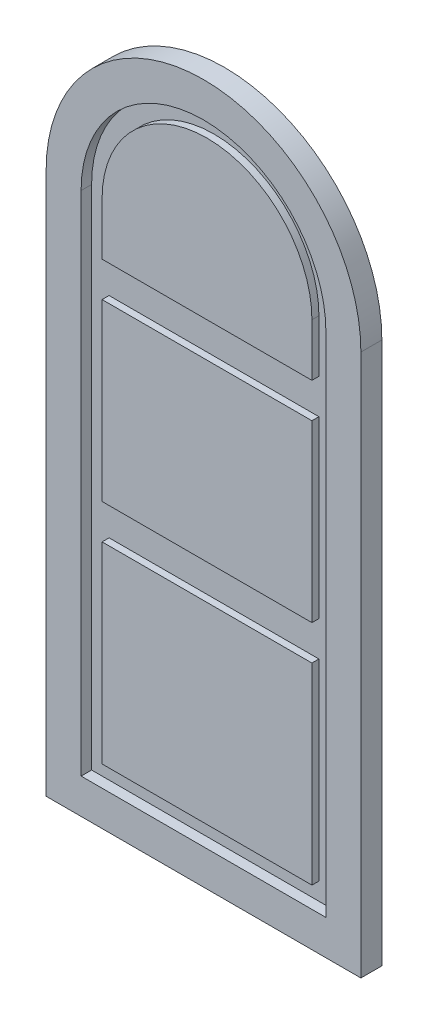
from build123d import *

# Parameters (mm, degrees)
SALIENTE_EXTRUIR1_DEPTH   = 60
SALIENTE_EXTRUIR2_DEPTH   = 50
CROQUIS1_3_W              = 600
CROQUIS1_3_H              = 500
SALIENTE_EXTRUIR2_2_DEPTH = 50
CROQUIS1_3_H_2            = 550
SALIENTE_EXTRUIR2_3_DEPTH = 50
CROQUIS1_4_W              = 600
CROQUIS1_4_H              = 550
CROQUIS1_4_H_2            = 500
SALIENTE_EXTRUIR3_DEPTH   = 30


with BuildPart() as part:
    # Croquis1 → Saliente-Extruir1 (new body)
    with BuildSketch(Plane.XY):
        with BuildLine():
            Line((405.722904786, 463.754283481), (405.722904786, -1086.245716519))
            Line((405.722904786, -1086.245716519), (-494.277095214, -1086.245716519))
            Line((-494.277095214, -1086.245716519), (-494.277095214, 463.754283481))
            ThreePointArc((-494.277095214, 463.754283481), (-44.277095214, 913.754283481), (405.722904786, 463.754283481))
        make_face()
        with BuildLine():
            ThreePointArc((305.722904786, 463.754283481), (-44.277095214, 813.754283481), (-394.277095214, 463.754283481))
            Line((-394.277095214, 463.754283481), (-394.277095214, -986.245716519))
            Line((-394.277095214, -986.245716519), (305.722904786, -986.245716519))
            Line((305.722904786, -986.245716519), (305.722904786, 463.754283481))
        make_face(mode=Mode.SUBTRACT)
    extrude(amount=SALIENTE_EXTRUIR1_DEPTH)



with BuildPart() as body_2:
    # Croquis1_3 → Saliente-Extruir2 (new body)
    with BuildSketch(Plane.XY):
        with BuildLine():
            Line((255.722904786, 313.754283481), (255.722904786, 463.754283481))
            ThreePointArc((255.722904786, 463.754283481), (-44.277095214, 763.754283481), (-344.277095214, 463.754283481))
            Line((-344.277095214, 463.754283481), (-344.277095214, 313.754283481))
            Line((-344.277095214, 313.754283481), (255.722904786, 313.754283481))
        make_face()
    extrude(amount=SALIENTE_EXTRUIR2_DEPTH)


with BuildPart() as body_3:
    # Croquis1_3 → Saliente-Extruir2 2 (new body)
    with BuildSketch(Plane.XY):
        with Locations((-44.277095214, -36.245716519)):
            Rectangle(CROQUIS1_3_W, CROQUIS1_3_H)
    extrude(amount=SALIENTE_EXTRUIR2_2_DEPTH)


with BuildPart() as body_4:
    # Croquis1_3 → Saliente-Extruir2 3 (new body)
    with BuildSketch(Plane.XY):
        with Locations((-44.277095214, -661.245716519)):
            Rectangle(CROQUIS1_3_W, CROQUIS1_3_H_2)
    extrude(amount=SALIENTE_EXTRUIR2_3_DEPTH)


with BuildPart() as part_1:
    add(part.part)

    add(body_2.part)  # Saliente-Extruir3 merges body 2

    add(body_3.part)  # Saliente-Extruir3 merges body 3

    add(body_4.part)  # Saliente-Extruir3 merges body 4
    # Croquis1_4 → Saliente-Extruir3 (add)
    with BuildSketch(Plane.XY):
        with BuildLine():
            Line((305.722904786, 463.754283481), (305.722904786, -986.245716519))
            Line((305.722904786, -986.245716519), (-394.277095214, -986.245716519))
            Line((-394.277095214, -986.245716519), (-394.277095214, 463.754283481))
            ThreePointArc((-394.277095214, 463.754283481), (-44.277095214, 813.754283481), (305.722904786, 463.754283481))
        make_face()
        with BuildLine():
            ThreePointArc((255.722904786, 463.754283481), (-44.277095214, 763.754283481), (-344.277095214, 463.754283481))
            Line((-344.277095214, 463.754283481), (-344.277095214, 313.754283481))
            Line((-344.277095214, 313.754283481), (255.722904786, 313.754283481))
            Line((255.722904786, 313.754283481), (255.722904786, 463.754283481))
        make_face(mode=Mode.SUBTRACT)
        with Locations((-44.277095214, -661.245716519)):
            Rectangle(CROQUIS1_4_W, CROQUIS1_4_H, mode=Mode.SUBTRACT)
        with Locations((-44.277095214, -36.245716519)):
            Rectangle(CROQUIS1_4_W, CROQUIS1_4_H_2, mode=Mode.SUBTRACT)
    extrude(amount=SALIENTE_EXTRUIR3_DEPTH)


solid = part_1.part
